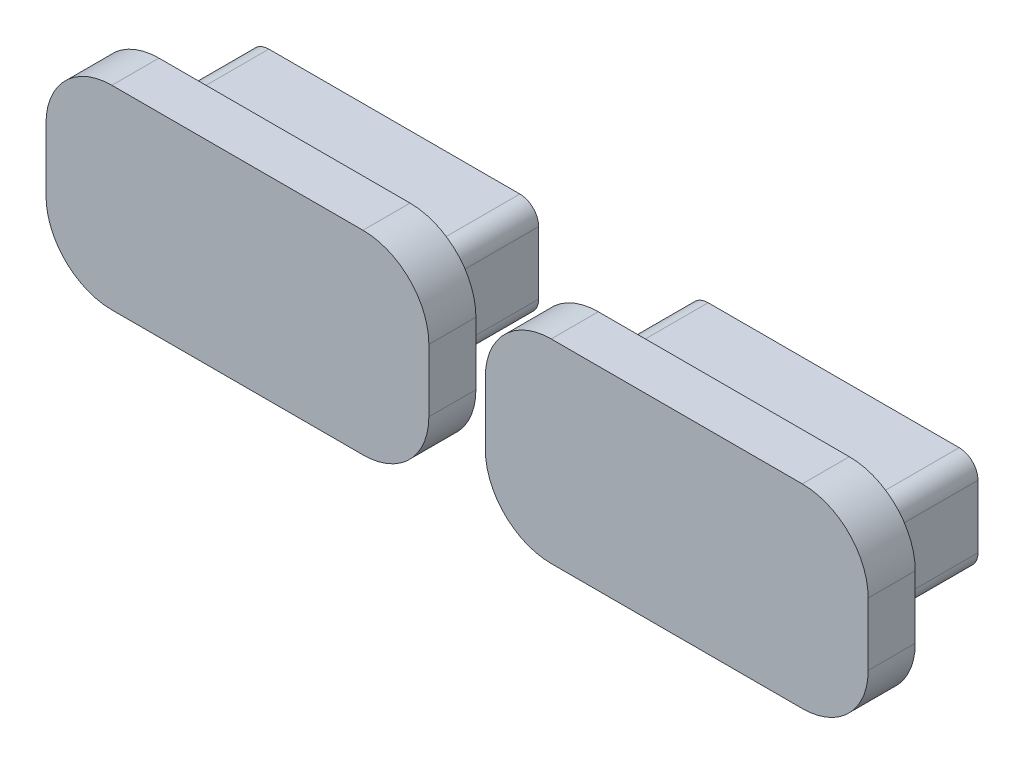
ISO-10303-21;
HEADER;
FILE_DESCRIPTION(('STEP AP214'),'2;1');
FILE_NAME('part.step','',(''),(''),'','','');
FILE_SCHEMA(('AUTOMOTIVE_DESIGN { 1 0 10303 214 1 1 1 1 }'));
ENDSEC;
DATA;
#1=APPLICATION_CONTEXT('core data for automotive mechanical design processes');
#2=APPLICATION_PROTOCOL_DEFINITION('international standard','automotive_design',2000,#1);
#3=PRODUCT_CONTEXT('',#1,'mechanical');
#4=PRODUCT('Part','Part','',(#3));
#5=PRODUCT_RELATED_PRODUCT_CATEGORY('part','',(#4));
#6=PRODUCT_DEFINITION_FORMATION('','',#4);
#7=PRODUCT_DEFINITION_CONTEXT('part definition',#1,'design');
#8=PRODUCT_DEFINITION('design','',#6,#7);
#9=PRODUCT_DEFINITION_SHAPE('','',#8);
#10=(LENGTH_UNIT() NAMED_UNIT(*) SI_UNIT(.MILLI.,.METRE.));
#11=(NAMED_UNIT(*) PLANE_ANGLE_UNIT() SI_UNIT($,.RADIAN.));
#12=(NAMED_UNIT(*) SI_UNIT($,.STERADIAN.) SOLID_ANGLE_UNIT());
#13=UNCERTAINTY_MEASURE_WITH_UNIT(LENGTH_MEASURE(1.E-05),#10,'distance_accuracy_value','');
#14=(GEOMETRIC_REPRESENTATION_CONTEXT(3) GLOBAL_UNCERTAINTY_ASSIGNED_CONTEXT((#13)) GLOBAL_UNIT_ASSIGNED_CONTEXT((#10,
#11,#12)) REPRESENTATION_CONTEXT('',''));
#15=CARTESIAN_POINT('',(0.,0.,0.));
#16=DIRECTION('',(0.,0.,1.));
#17=DIRECTION('',(1.,0.,0.));
#18=AXIS2_PLACEMENT_3D('',#15,#16,#17);
#19=CARTESIAN_POINT('',(34.2749999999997,-52.705,-18.7206083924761));
#20=DIRECTION('',(0.,0.,1.));
#21=DIRECTION('',(1.,0.,0.));
#22=AXIS2_PLACEMENT_3D('',#19,#20,#21);
#23=CYLINDRICAL_SURFACE('',#22,0.761999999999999);
#24=CARTESIAN_POINT('',(34.2749999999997,-52.705,-6.35));
#25=DIRECTION('',(0.,0.,-1.));
#26=DIRECTION('',(-1.,0.,0.));
#27=AXIS2_PLACEMENT_3D('',#24,#25,#26);
#28=CIRCLE('',#27,0.761999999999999);
#29=CARTESIAN_POINT('',(34.2749999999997,-51.943,-6.35));
#30=VERTEX_POINT('',#29);
#31=CARTESIAN_POINT('',(35.0369999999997,-52.705,-6.35));
#32=VERTEX_POINT('',#31);
#33=EDGE_CURVE('E142',#30,#32,#28,.T.);
#34=ORIENTED_EDGE('',*,*,#33,.F.);
#35=DIRECTION('',(0.,0.,1.));
#36=VECTOR('',#35,1.);
#37=CARTESIAN_POINT('',(34.2749999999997,-51.943,-18.7206083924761));
#38=LINE('',#37,#36);
#39=CARTESIAN_POINT('',(34.2749999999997,-51.943,-1.905));
#40=VERTEX_POINT('',#39);
#41=EDGE_CURVE('E47',#30,#40,#38,.T.);
#42=ORIENTED_EDGE('',*,*,#41,.T.);
#43=CARTESIAN_POINT('',(34.2749999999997,-52.705,-1.905));
#44=DIRECTION('',(0.,0.,-1.));
#45=DIRECTION('',(-1.,0.,0.));
#46=AXIS2_PLACEMENT_3D('',#43,#44,#45);
#47=CIRCLE('',#46,0.761999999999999);
#48=CARTESIAN_POINT('',(35.0369999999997,-52.705,-1.905));
#49=VERTEX_POINT('',#48);
#50=EDGE_CURVE('E150',#40,#49,#47,.T.);
#51=ORIENTED_EDGE('',*,*,#50,.T.);
#52=DIRECTION('',(0.,0.,1.));
#53=VECTOR('',#52,1.);
#54=CARTESIAN_POINT('',(35.0369999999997,-52.705,-18.7206083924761));
#55=LINE('',#54,#53);
#56=EDGE_CURVE('E98',#32,#49,#55,.T.);
#57=ORIENTED_EDGE('',*,*,#56,.F.);
#58=EDGE_LOOP('',(#34,#42,#51,#57));
#59=FACE_BOUND('',#58,.T.);
#60=ADVANCED_FACE('F43',(#59),#23,.T.);
#61=CARTESIAN_POINT('',(35.0369999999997,-52.705,-18.7206083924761));
#62=DIRECTION('',(-1.,0.,0.));
#63=DIRECTION('',(0.,0.,1.));
#64=AXIS2_PLACEMENT_3D('',#61,#62,#63);
#65=PLANE('',#64);
#66=DIRECTION('',(0.,-1.,0.));
#67=VECTOR('',#66,1.);
#68=CARTESIAN_POINT('',(35.0369999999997,-52.705,-6.35));
#69=LINE('',#68,#67);
#70=CARTESIAN_POINT('',(35.0369999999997,-55.245,-6.35));
#71=VERTEX_POINT('',#70);
#72=EDGE_CURVE('E105',#32,#71,#69,.T.);
#73=ORIENTED_EDGE('',*,*,#72,.F.);
#74=ORIENTED_EDGE('',*,*,#56,.T.);
#75=DIRECTION('',(0.,-1.,0.));
#76=VECTOR('',#75,1.);
#77=CARTESIAN_POINT('',(35.0369999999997,-52.705,-1.905));
#78=LINE('',#77,#76);
#79=CARTESIAN_POINT('',(35.0369999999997,-55.245,-1.905));
#80=VERTEX_POINT('',#79);
#81=EDGE_CURVE('E149',#49,#80,#78,.T.);
#82=ORIENTED_EDGE('',*,*,#81,.T.);
#83=DIRECTION('',(0.,0.,1.));
#84=VECTOR('',#83,1.);
#85=CARTESIAN_POINT('',(35.0369999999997,-55.245,-18.7206083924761));
#86=LINE('',#85,#84);
#87=EDGE_CURVE('E151',#71,#80,#86,.T.);
#88=ORIENTED_EDGE('',*,*,#87,.F.);
#89=EDGE_LOOP('',(#73,#74,#82,#88));
#90=FACE_BOUND('',#89,.T.);
#91=ADVANCED_FACE('F180',(#90),#65,.F.);
#92=CARTESIAN_POINT('',(34.2749999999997,-55.245,-18.7206083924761));
#93=DIRECTION('',(0.,0.,1.));
#94=DIRECTION('',(1.,0.,0.));
#95=AXIS2_PLACEMENT_3D('',#92,#93,#94);
#96=CYLINDRICAL_SURFACE('',#95,0.761999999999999);
#97=CARTESIAN_POINT('',(34.2749999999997,-55.245,-6.35));
#98=DIRECTION('',(0.,0.,-1.));
#99=DIRECTION('',(-1.,0.,0.));
#100=AXIS2_PLACEMENT_3D('',#97,#98,#99);
#101=CIRCLE('',#100,0.761999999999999);
#102=CARTESIAN_POINT('',(34.2749999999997,-56.007,-6.35));
#103=VERTEX_POINT('',#102);
#104=EDGE_CURVE('E138',#71,#103,#101,.T.);
#105=ORIENTED_EDGE('',*,*,#104,.F.);
#106=ORIENTED_EDGE('',*,*,#87,.T.);
#107=CARTESIAN_POINT('',(34.2749999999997,-55.245,-1.905));
#108=DIRECTION('',(0.,0.,-1.));
#109=DIRECTION('',(-1.,0.,0.));
#110=AXIS2_PLACEMENT_3D('',#107,#108,#109);
#111=CIRCLE('',#110,0.761999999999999);
#112=CARTESIAN_POINT('',(34.2749999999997,-56.007,-1.905));
#113=VERTEX_POINT('',#112);
#114=EDGE_CURVE('E153',#80,#113,#111,.T.);
#115=ORIENTED_EDGE('',*,*,#114,.T.);
#116=DIRECTION('',(0.,0.,1.));
#117=VECTOR('',#116,1.);
#118=CARTESIAN_POINT('',(34.2749999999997,-56.007,-18.7206083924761));
#119=LINE('',#118,#117);
#120=EDGE_CURVE('E154',#103,#113,#119,.T.);
#121=ORIENTED_EDGE('',*,*,#120,.F.);
#122=EDGE_LOOP('',(#105,#106,#115,#121));
#123=FACE_BOUND('',#122,.T.);
#124=ADVANCED_FACE('F183',(#123),#96,.T.);
#125=CARTESIAN_POINT('',(34.2749999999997,-56.007,-18.7206083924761));
#126=DIRECTION('',(0.,1.,0.));
#127=DIRECTION('',(0.,0.,1.));
#128=AXIS2_PLACEMENT_3D('',#125,#126,#127);
#129=PLANE('',#128);
#130=DIRECTION('',(-1.,0.,0.));
#131=VECTOR('',#130,1.);
#132=CARTESIAN_POINT('',(34.2749999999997,-56.007,-6.35));
#133=LINE('',#132,#131);
#134=CARTESIAN_POINT('',(24.1149999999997,-56.007,-6.35));
#135=VERTEX_POINT('',#134);
#136=EDGE_CURVE('E133',#103,#135,#133,.T.);
#137=ORIENTED_EDGE('',*,*,#136,.F.);
#138=ORIENTED_EDGE('',*,*,#120,.T.);
#139=DIRECTION('',(-1.,0.,0.));
#140=VECTOR('',#139,1.);
#141=CARTESIAN_POINT('',(34.2749999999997,-56.007,-1.905));
#142=LINE('',#141,#140);
#143=CARTESIAN_POINT('',(24.1149999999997,-56.007,-1.905));
#144=VERTEX_POINT('',#143);
#145=EDGE_CURVE('E156',#113,#144,#142,.T.);
#146=ORIENTED_EDGE('',*,*,#145,.T.);
#147=DIRECTION('',(0.,0.,1.));
#148=VECTOR('',#147,1.);
#149=CARTESIAN_POINT('',(24.1149999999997,-56.007,-18.7206083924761));
#150=LINE('',#149,#148);
#151=EDGE_CURVE('E157',#135,#144,#150,.T.);
#152=ORIENTED_EDGE('',*,*,#151,.F.);
#153=EDGE_LOOP('',(#137,#138,#146,#152));
#154=FACE_BOUND('',#153,.T.);
#155=ADVANCED_FACE('F185',(#154),#129,.F.);
#156=CARTESIAN_POINT('',(24.1149999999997,-55.245,-18.7206083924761));
#157=DIRECTION('',(0.,0.,1.));
#158=DIRECTION('',(1.,0.,0.));
#159=AXIS2_PLACEMENT_3D('',#156,#157,#158);
#160=CYLINDRICAL_SURFACE('',#159,0.761999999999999);
#161=CARTESIAN_POINT('',(24.1149999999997,-55.245,-6.35));
#162=DIRECTION('',(0.,0.,-1.));
#163=DIRECTION('',(-1.,0.,0.));
#164=AXIS2_PLACEMENT_3D('',#161,#162,#163);
#165=CIRCLE('',#164,0.761999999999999);
#166=CARTESIAN_POINT('',(23.3529999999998,-55.245,-6.35));
#167=VERTEX_POINT('',#166);
#168=EDGE_CURVE('E131',#135,#167,#165,.T.);
#169=ORIENTED_EDGE('',*,*,#168,.F.);
#170=ORIENTED_EDGE('',*,*,#151,.T.);
#171=CARTESIAN_POINT('',(24.1149999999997,-55.245,-1.905));
#172=DIRECTION('',(0.,0.,-1.));
#173=DIRECTION('',(-1.,0.,0.));
#174=AXIS2_PLACEMENT_3D('',#171,#172,#173);
#175=CIRCLE('',#174,0.761999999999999);
#176=CARTESIAN_POINT('',(23.3529999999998,-55.245,-1.905));
#177=VERTEX_POINT('',#176);
#178=EDGE_CURVE('E159',#144,#177,#175,.T.);
#179=ORIENTED_EDGE('',*,*,#178,.T.);
#180=DIRECTION('',(0.,0.,1.));
#181=VECTOR('',#180,1.);
#182=CARTESIAN_POINT('',(23.3529999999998,-55.245,-18.7206083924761));
#183=LINE('',#182,#181);
#184=EDGE_CURVE('E160',#167,#177,#183,.T.);
#185=ORIENTED_EDGE('',*,*,#184,.F.);
#186=EDGE_LOOP('',(#169,#170,#179,#185));
#187=FACE_BOUND('',#186,.T.);
#188=ADVANCED_FACE('F189',(#187),#160,.T.);
#189=CARTESIAN_POINT('',(23.3529999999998,-55.245,-18.7206083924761));
#190=DIRECTION('',(1.,0.,0.));
#191=DIRECTION('',(0.,0.,-1.));
#192=AXIS2_PLACEMENT_3D('',#189,#190,#191);
#193=PLANE('',#192);
#194=DIRECTION('',(0.,1.,0.));
#195=VECTOR('',#194,1.);
#196=CARTESIAN_POINT('',(23.3529999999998,-55.245,-6.35));
#197=LINE('',#196,#195);
#198=CARTESIAN_POINT('',(23.3529999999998,-52.705,-6.35));
#199=VERTEX_POINT('',#198);
#200=EDGE_CURVE('E52',#167,#199,#197,.T.);
#201=ORIENTED_EDGE('',*,*,#200,.F.);
#202=ORIENTED_EDGE('',*,*,#184,.T.);
#203=DIRECTION('',(0.,1.,0.));
#204=VECTOR('',#203,1.);
#205=CARTESIAN_POINT('',(23.3529999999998,-55.245,-1.905));
#206=LINE('',#205,#204);
#207=CARTESIAN_POINT('',(23.3529999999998,-52.705,-1.905));
#208=VERTEX_POINT('',#207);
#209=EDGE_CURVE('E125',#177,#208,#206,.T.);
#210=ORIENTED_EDGE('',*,*,#209,.T.);
#211=DIRECTION('',(0.,0.,1.));
#212=VECTOR('',#211,1.);
#213=CARTESIAN_POINT('',(23.3529999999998,-52.705,-18.7206083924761));
#214=LINE('',#213,#212);
#215=EDGE_CURVE('E116',#199,#208,#214,.T.);
#216=ORIENTED_EDGE('',*,*,#215,.F.);
#217=EDGE_LOOP('',(#201,#202,#210,#216));
#218=FACE_BOUND('',#217,.T.);
#219=ADVANCED_FACE('F122',(#218),#193,.F.);
#220=CARTESIAN_POINT('',(24.1149999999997,-52.705,-18.7206083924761));
#221=DIRECTION('',(0.,0.,1.));
#222=DIRECTION('',(1.,0.,0.));
#223=AXIS2_PLACEMENT_3D('',#220,#221,#222);
#224=CYLINDRICAL_SURFACE('',#223,0.761999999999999);
#225=CARTESIAN_POINT('',(24.1149999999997,-52.705,-6.35));
#226=DIRECTION('',(0.,0.,-1.));
#227=DIRECTION('',(-1.,0.,0.));
#228=AXIS2_PLACEMENT_3D('',#225,#226,#227);
#229=CIRCLE('',#228,0.761999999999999);
#230=CARTESIAN_POINT('',(24.1149999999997,-51.943,-6.35));
#231=VERTEX_POINT('',#230);
#232=EDGE_CURVE('E12',#199,#231,#229,.T.);
#233=ORIENTED_EDGE('',*,*,#232,.F.);
#234=ORIENTED_EDGE('',*,*,#215,.T.);
#235=CARTESIAN_POINT('',(24.1149999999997,-52.705,-1.905));
#236=DIRECTION('',(0.,0.,-1.));
#237=DIRECTION('',(-1.,0.,0.));
#238=AXIS2_PLACEMENT_3D('',#235,#236,#237);
#239=CIRCLE('',#238,0.761999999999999);
#240=CARTESIAN_POINT('',(24.1149999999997,-51.943,-1.905));
#241=VERTEX_POINT('',#240);
#242=EDGE_CURVE('E127',#208,#241,#239,.T.);
#243=ORIENTED_EDGE('',*,*,#242,.T.);
#244=DIRECTION('',(0.,0.,1.));
#245=VECTOR('',#244,1.);
#246=CARTESIAN_POINT('',(24.1149999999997,-51.943,-18.7206083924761));
#247=LINE('',#246,#245);
#248=EDGE_CURVE('E65',#231,#241,#247,.T.);
#249=ORIENTED_EDGE('',*,*,#248,.F.);
#250=EDGE_LOOP('',(#233,#234,#243,#249));
#251=FACE_BOUND('',#250,.T.);
#252=ADVANCED_FACE('F115',(#251),#224,.T.);
#253=CARTESIAN_POINT('',(24.1149999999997,-51.943,-18.7206083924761));
#254=DIRECTION('',(0.,-1.,0.));
#255=DIRECTION('',(0.,0.,-1.));
#256=AXIS2_PLACEMENT_3D('',#253,#254,#255);
#257=PLANE('',#256);
#258=DIRECTION('',(1.,0.,0.));
#259=VECTOR('',#258,1.);
#260=CARTESIAN_POINT('',(24.1149999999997,-51.943,-6.35));
#261=LINE('',#260,#259);
#262=EDGE_CURVE('E145',#231,#30,#261,.T.);
#263=ORIENTED_EDGE('',*,*,#262,.F.);
#264=ORIENTED_EDGE('',*,*,#248,.T.);
#265=DIRECTION('',(1.,0.,0.));
#266=VECTOR('',#265,1.);
#267=CARTESIAN_POINT('',(24.1149999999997,-51.943,-1.905));
#268=LINE('',#267,#266);
#269=EDGE_CURVE('E147',#241,#40,#268,.T.);
#270=ORIENTED_EDGE('',*,*,#269,.T.);
#271=ORIENTED_EDGE('',*,*,#41,.F.);
#272=EDGE_LOOP('',(#263,#264,#270,#271));
#273=FACE_BOUND('',#272,.T.);
#274=ADVANCED_FACE('F175',(#273),#257,.F.);
#275=CARTESIAN_POINT('',(34.2749999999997,-52.705,-1.905));
#276=DIRECTION('',(0.,0.,-1.));
#277=DIRECTION('',(-1.,0.,0.));
#278=AXIS2_PLACEMENT_3D('',#275,#276,#277);
#279=PLANE('',#278);
#280=ORIENTED_EDGE('',*,*,#50,.F.);
#281=ORIENTED_EDGE('',*,*,#269,.F.);
#282=ORIENTED_EDGE('',*,*,#242,.F.);
#283=ORIENTED_EDGE('',*,*,#209,.F.);
#284=ORIENTED_EDGE('',*,*,#178,.F.);
#285=ORIENTED_EDGE('',*,*,#145,.F.);
#286=ORIENTED_EDGE('',*,*,#114,.F.);
#287=ORIENTED_EDGE('',*,*,#81,.F.);
#288=EDGE_LOOP('',(#280,#281,#282,#283,#284,#285,#286,#287));
#289=FACE_BOUND('',#288,.T.);
#290=ADVANCED_FACE('F177',(#289),#279,.F.);
#291=CARTESIAN_POINT('',(-36.785,-36.195,-6.35));
#292=DIRECTION('',(0.,0.,-1.));
#293=DIRECTION('',(-1.,0.,0.));
#294=AXIS2_PLACEMENT_3D('',#291,#292,#293);
#295=PLANE('',#294);
#296=ORIENTED_EDGE('',*,*,#262,.T.);
#297=ORIENTED_EDGE('',*,*,#33,.T.);
#298=ORIENTED_EDGE('',*,*,#72,.T.);
#299=ORIENTED_EDGE('',*,*,#104,.T.);
#300=ORIENTED_EDGE('',*,*,#136,.T.);
#301=ORIENTED_EDGE('',*,*,#168,.T.);
#302=ORIENTED_EDGE('',*,*,#200,.T.);
#303=ORIENTED_EDGE('',*,*,#232,.T.);
#304=EDGE_LOOP('',(#296,#297,#298,#299,#300,#301,#302,#303));
#305=FACE_BOUND('',#304,.T.);
#306=ADVANCED_FACE('F45',(#305),#295,.T.);
#307=CLOSED_SHELL('',(#60,#91,#124,#155,#188,#219,#252,#274,#290,#306));
#308=MANIFOLD_SOLID_BREP('B2',#307);
#309=CARTESIAN_POINT('',(6.33499999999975,-55.245,-18.7206083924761));
#310=DIRECTION('',(0.,0.,1.));
#311=DIRECTION('',(1.,0.,0.));
#312=AXIS2_PLACEMENT_3D('',#309,#310,#311);
#313=CYLINDRICAL_SURFACE('',#312,0.762);
#314=CARTESIAN_POINT('',(6.33499999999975,-55.245,-6.35));
#315=DIRECTION('',(0.,0.,-1.));
#316=DIRECTION('',(-1.,0.,0.));
#317=AXIS2_PLACEMENT_3D('',#314,#315,#316);
#318=CIRCLE('',#317,0.762);
#319=CARTESIAN_POINT('',(6.33499999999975,-56.007,-6.35));
#320=VERTEX_POINT('',#319);
#321=CARTESIAN_POINT('',(5.57299999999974,-55.245,-6.35));
#322=VERTEX_POINT('',#321);
#323=EDGE_CURVE('E379',#320,#322,#318,.T.);
#324=ORIENTED_EDGE('',*,*,#323,.F.);
#325=DIRECTION('',(0.,0.,1.));
#326=VECTOR('',#325,1.);
#327=CARTESIAN_POINT('',(6.33499999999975,-56.007,-18.7206083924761));
#328=LINE('',#327,#326);
#329=CARTESIAN_POINT('',(6.33499999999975,-56.007,-1.905));
#330=VERTEX_POINT('',#329);
#331=EDGE_CURVE('E284',#320,#330,#328,.T.);
#332=ORIENTED_EDGE('',*,*,#331,.T.);
#333=CARTESIAN_POINT('',(6.33499999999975,-55.245,-1.905));
#334=DIRECTION('',(0.,0.,-1.));
#335=DIRECTION('',(-1.,0.,0.));
#336=AXIS2_PLACEMENT_3D('',#333,#334,#335);
#337=CIRCLE('',#336,0.762);
#338=CARTESIAN_POINT('',(5.57299999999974,-55.245,-1.905));
#339=VERTEX_POINT('',#338);
#340=EDGE_CURVE('E387',#330,#339,#337,.T.);
#341=ORIENTED_EDGE('',*,*,#340,.T.);
#342=DIRECTION('',(0.,0.,1.));
#343=VECTOR('',#342,1.);
#344=CARTESIAN_POINT('',(5.57299999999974,-55.245,-18.7206083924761));
#345=LINE('',#344,#343);
#346=EDGE_CURVE('E335',#322,#339,#345,.T.);
#347=ORIENTED_EDGE('',*,*,#346,.F.);
#348=EDGE_LOOP('',(#324,#332,#341,#347));
#349=FACE_BOUND('',#348,.T.);
#350=ADVANCED_FACE('F280',(#349),#313,.T.);
#351=CARTESIAN_POINT('',(5.57299999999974,-55.245,-18.7206083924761));
#352=DIRECTION('',(1.,0.,0.));
#353=DIRECTION('',(0.,0.,-1.));
#354=AXIS2_PLACEMENT_3D('',#351,#352,#353);
#355=PLANE('',#354);
#356=DIRECTION('',(0.,1.,0.));
#357=VECTOR('',#356,1.);
#358=CARTESIAN_POINT('',(5.57299999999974,-55.245,-6.35));
#359=LINE('',#358,#357);
#360=CARTESIAN_POINT('',(5.57299999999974,-52.705,-6.35));
#361=VERTEX_POINT('',#360);
#362=EDGE_CURVE('E342',#322,#361,#359,.T.);
#363=ORIENTED_EDGE('',*,*,#362,.F.);
#364=ORIENTED_EDGE('',*,*,#346,.T.);
#365=DIRECTION('',(0.,1.,0.));
#366=VECTOR('',#365,1.);
#367=CARTESIAN_POINT('',(5.57299999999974,-55.245,-1.905));
#368=LINE('',#367,#366);
#369=CARTESIAN_POINT('',(5.57299999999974,-52.705,-1.905));
#370=VERTEX_POINT('',#369);
#371=EDGE_CURVE('E386',#339,#370,#368,.T.);
#372=ORIENTED_EDGE('',*,*,#371,.T.);
#373=DIRECTION('',(0.,0.,1.));
#374=VECTOR('',#373,1.);
#375=CARTESIAN_POINT('',(5.57299999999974,-52.705,-18.7206083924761));
#376=LINE('',#375,#374);
#377=EDGE_CURVE('E388',#361,#370,#376,.T.);
#378=ORIENTED_EDGE('',*,*,#377,.F.);
#379=EDGE_LOOP('',(#363,#364,#372,#378));
#380=FACE_BOUND('',#379,.T.);
#381=ADVANCED_FACE('F417',(#380),#355,.F.);
#382=CARTESIAN_POINT('',(6.33499999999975,-52.705,-18.7206083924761));
#383=DIRECTION('',(0.,0.,1.));
#384=DIRECTION('',(1.,0.,0.));
#385=AXIS2_PLACEMENT_3D('',#382,#383,#384);
#386=CYLINDRICAL_SURFACE('',#385,0.762);
#387=CARTESIAN_POINT('',(6.33499999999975,-52.705,-6.35));
#388=DIRECTION('',(0.,0.,-1.));
#389=DIRECTION('',(-1.,0.,0.));
#390=AXIS2_PLACEMENT_3D('',#387,#388,#389);
#391=CIRCLE('',#390,0.762);
#392=CARTESIAN_POINT('',(6.33499999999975,-51.943,-6.35));
#393=VERTEX_POINT('',#392);
#394=EDGE_CURVE('E375',#361,#393,#391,.T.);
#395=ORIENTED_EDGE('',*,*,#394,.F.);
#396=ORIENTED_EDGE('',*,*,#377,.T.);
#397=CARTESIAN_POINT('',(6.33499999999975,-52.705,-1.905));
#398=DIRECTION('',(0.,0.,-1.));
#399=DIRECTION('',(-1.,0.,0.));
#400=AXIS2_PLACEMENT_3D('',#397,#398,#399);
#401=CIRCLE('',#400,0.762);
#402=CARTESIAN_POINT('',(6.33499999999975,-51.943,-1.905));
#403=VERTEX_POINT('',#402);
#404=EDGE_CURVE('E390',#370,#403,#401,.T.);
#405=ORIENTED_EDGE('',*,*,#404,.T.);
#406=DIRECTION('',(0.,0.,1.));
#407=VECTOR('',#406,1.);
#408=CARTESIAN_POINT('',(6.33499999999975,-51.943,-18.7206083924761));
#409=LINE('',#408,#407);
#410=EDGE_CURVE('E391',#393,#403,#409,.T.);
#411=ORIENTED_EDGE('',*,*,#410,.F.);
#412=EDGE_LOOP('',(#395,#396,#405,#411));
#413=FACE_BOUND('',#412,.T.);
#414=ADVANCED_FACE('F420',(#413),#386,.T.);
#415=CARTESIAN_POINT('',(6.33499999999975,-51.943,-18.7206083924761));
#416=DIRECTION('',(0.,-1.,0.));
#417=DIRECTION('',(0.,0.,-1.));
#418=AXIS2_PLACEMENT_3D('',#415,#416,#417);
#419=PLANE('',#418);
#420=DIRECTION('',(1.,0.,0.));
#421=VECTOR('',#420,1.);
#422=CARTESIAN_POINT('',(6.33499999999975,-51.943,-6.35));
#423=LINE('',#422,#421);
#424=CARTESIAN_POINT('',(16.4949999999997,-51.943,-6.35));
#425=VERTEX_POINT('',#424);
#426=EDGE_CURVE('E370',#393,#425,#423,.T.);
#427=ORIENTED_EDGE('',*,*,#426,.F.);
#428=ORIENTED_EDGE('',*,*,#410,.T.);
#429=DIRECTION('',(1.,0.,0.));
#430=VECTOR('',#429,1.);
#431=CARTESIAN_POINT('',(6.33499999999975,-51.943,-1.905));
#432=LINE('',#431,#430);
#433=CARTESIAN_POINT('',(16.4949999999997,-51.943,-1.905));
#434=VERTEX_POINT('',#433);
#435=EDGE_CURVE('E393',#403,#434,#432,.T.);
#436=ORIENTED_EDGE('',*,*,#435,.T.);
#437=DIRECTION('',(0.,0.,1.));
#438=VECTOR('',#437,1.);
#439=CARTESIAN_POINT('',(16.4949999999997,-51.943,-18.7206083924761));
#440=LINE('',#439,#438);
#441=EDGE_CURVE('E394',#425,#434,#440,.T.);
#442=ORIENTED_EDGE('',*,*,#441,.F.);
#443=EDGE_LOOP('',(#427,#428,#436,#442));
#444=FACE_BOUND('',#443,.T.);
#445=ADVANCED_FACE('F422',(#444),#419,.F.);
#446=CARTESIAN_POINT('',(16.4949999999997,-52.705,-18.7206083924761));
#447=DIRECTION('',(0.,0.,1.));
#448=DIRECTION('',(1.,0.,0.));
#449=AXIS2_PLACEMENT_3D('',#446,#447,#448);
#450=CYLINDRICAL_SURFACE('',#449,0.761999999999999);
#451=CARTESIAN_POINT('',(16.4949999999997,-52.705,-6.35));
#452=DIRECTION('',(0.,0.,-1.));
#453=DIRECTION('',(-1.,0.,0.));
#454=AXIS2_PLACEMENT_3D('',#451,#452,#453);
#455=CIRCLE('',#454,0.761999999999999);
#456=CARTESIAN_POINT('',(17.2569999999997,-52.705,-6.35));
#457=VERTEX_POINT('',#456);
#458=EDGE_CURVE('E368',#425,#457,#455,.T.);
#459=ORIENTED_EDGE('',*,*,#458,.F.);
#460=ORIENTED_EDGE('',*,*,#441,.T.);
#461=CARTESIAN_POINT('',(16.4949999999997,-52.705,-1.905));
#462=DIRECTION('',(0.,0.,-1.));
#463=DIRECTION('',(-1.,0.,0.));
#464=AXIS2_PLACEMENT_3D('',#461,#462,#463);
#465=CIRCLE('',#464,0.761999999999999);
#466=CARTESIAN_POINT('',(17.2569999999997,-52.705,-1.905));
#467=VERTEX_POINT('',#466);
#468=EDGE_CURVE('E396',#434,#467,#465,.T.);
#469=ORIENTED_EDGE('',*,*,#468,.T.);
#470=DIRECTION('',(0.,0.,1.));
#471=VECTOR('',#470,1.);
#472=CARTESIAN_POINT('',(17.2569999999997,-52.705,-18.7206083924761));
#473=LINE('',#472,#471);
#474=EDGE_CURVE('E397',#457,#467,#473,.T.);
#475=ORIENTED_EDGE('',*,*,#474,.F.);
#476=EDGE_LOOP('',(#459,#460,#469,#475));
#477=FACE_BOUND('',#476,.T.);
#478=ADVANCED_FACE('F426',(#477),#450,.T.);
#479=CARTESIAN_POINT('',(17.2569999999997,-52.705,-18.7206083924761));
#480=DIRECTION('',(-1.,0.,0.));
#481=DIRECTION('',(0.,0.,1.));
#482=AXIS2_PLACEMENT_3D('',#479,#480,#481);
#483=PLANE('',#482);
#484=DIRECTION('',(0.,-1.,0.));
#485=VECTOR('',#484,1.);
#486=CARTESIAN_POINT('',(17.2569999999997,-52.705,-6.35));
#487=LINE('',#486,#485);
#488=CARTESIAN_POINT('',(17.2569999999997,-55.245,-6.35));
#489=VERTEX_POINT('',#488);
#490=EDGE_CURVE('E289',#457,#489,#487,.T.);
#491=ORIENTED_EDGE('',*,*,#490,.F.);
#492=ORIENTED_EDGE('',*,*,#474,.T.);
#493=DIRECTION('',(0.,-1.,0.));
#494=VECTOR('',#493,1.);
#495=CARTESIAN_POINT('',(17.2569999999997,-52.705,-1.905));
#496=LINE('',#495,#494);
#497=CARTESIAN_POINT('',(17.2569999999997,-55.245,-1.905));
#498=VERTEX_POINT('',#497);
#499=EDGE_CURVE('E362',#467,#498,#496,.T.);
#500=ORIENTED_EDGE('',*,*,#499,.T.);
#501=DIRECTION('',(0.,0.,1.));
#502=VECTOR('',#501,1.);
#503=CARTESIAN_POINT('',(17.2569999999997,-55.245,-18.7206083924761));
#504=LINE('',#503,#502);
#505=EDGE_CURVE('E353',#489,#498,#504,.T.);
#506=ORIENTED_EDGE('',*,*,#505,.F.);
#507=EDGE_LOOP('',(#491,#492,#500,#506));
#508=FACE_BOUND('',#507,.T.);
#509=ADVANCED_FACE('F359',(#508),#483,.F.);
#510=CARTESIAN_POINT('',(16.4949999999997,-55.245,-18.7206083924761));
#511=DIRECTION('',(0.,0.,1.));
#512=DIRECTION('',(1.,0.,0.));
#513=AXIS2_PLACEMENT_3D('',#510,#511,#512);
#514=CYLINDRICAL_SURFACE('',#513,0.761999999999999);
#515=CARTESIAN_POINT('',(16.4949999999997,-55.245,-6.35));
#516=DIRECTION('',(0.,0.,-1.));
#517=DIRECTION('',(-1.,0.,0.));
#518=AXIS2_PLACEMENT_3D('',#515,#516,#517);
#519=CIRCLE('',#518,0.761999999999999);
#520=CARTESIAN_POINT('',(16.4949999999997,-56.007,-6.35));
#521=VERTEX_POINT('',#520);
#522=EDGE_CURVE('E41',#489,#521,#519,.T.);
#523=ORIENTED_EDGE('',*,*,#522,.F.);
#524=ORIENTED_EDGE('',*,*,#505,.T.);
#525=CARTESIAN_POINT('',(16.4949999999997,-55.245,-1.905));
#526=DIRECTION('',(0.,0.,-1.));
#527=DIRECTION('',(-1.,0.,0.));
#528=AXIS2_PLACEMENT_3D('',#525,#526,#527);
#529=CIRCLE('',#528,0.761999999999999);
#530=CARTESIAN_POINT('',(16.4949999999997,-56.007,-1.905));
#531=VERTEX_POINT('',#530);
#532=EDGE_CURVE('E364',#498,#531,#529,.T.);
#533=ORIENTED_EDGE('',*,*,#532,.T.);
#534=DIRECTION('',(0.,0.,1.));
#535=VECTOR('',#534,1.);
#536=CARTESIAN_POINT('',(16.4949999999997,-56.007,-18.7206083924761));
#537=LINE('',#536,#535);
#538=EDGE_CURVE('E302',#521,#531,#537,.T.);
#539=ORIENTED_EDGE('',*,*,#538,.F.);
#540=EDGE_LOOP('',(#523,#524,#533,#539));
#541=FACE_BOUND('',#540,.T.);
#542=ADVANCED_FACE('F352',(#541),#514,.T.);
#543=CARTESIAN_POINT('',(16.4949999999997,-56.007,-18.7206083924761));
#544=DIRECTION('',(0.,1.,0.));
#545=DIRECTION('',(0.,0.,1.));
#546=AXIS2_PLACEMENT_3D('',#543,#544,#545);
#547=PLANE('',#546);
#548=DIRECTION('',(-1.,0.,0.));
#549=VECTOR('',#548,1.);
#550=CARTESIAN_POINT('',(16.4949999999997,-56.007,-6.35));
#551=LINE('',#550,#549);
#552=EDGE_CURVE('E382',#521,#320,#551,.T.);
#553=ORIENTED_EDGE('',*,*,#552,.F.);
#554=ORIENTED_EDGE('',*,*,#538,.T.);
#555=DIRECTION('',(-1.,0.,0.));
#556=VECTOR('',#555,1.);
#557=CARTESIAN_POINT('',(16.4949999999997,-56.007,-1.905));
#558=LINE('',#557,#556);
#559=EDGE_CURVE('E384',#531,#330,#558,.T.);
#560=ORIENTED_EDGE('',*,*,#559,.T.);
#561=ORIENTED_EDGE('',*,*,#331,.F.);
#562=EDGE_LOOP('',(#553,#554,#560,#561));
#563=FACE_BOUND('',#562,.T.);
#564=ADVANCED_FACE('F412',(#563),#547,.F.);
#565=CARTESIAN_POINT('',(6.33499999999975,-55.245,-1.905));
#566=DIRECTION('',(0.,0.,-1.));
#567=DIRECTION('',(-1.,0.,0.));
#568=AXIS2_PLACEMENT_3D('',#565,#566,#567);
#569=PLANE('',#568);
#570=ORIENTED_EDGE('',*,*,#340,.F.);
#571=ORIENTED_EDGE('',*,*,#559,.F.);
#572=ORIENTED_EDGE('',*,*,#532,.F.);
#573=ORIENTED_EDGE('',*,*,#499,.F.);
#574=ORIENTED_EDGE('',*,*,#468,.F.);
#575=ORIENTED_EDGE('',*,*,#435,.F.);
#576=ORIENTED_EDGE('',*,*,#404,.F.);
#577=ORIENTED_EDGE('',*,*,#371,.F.);
#578=EDGE_LOOP('',(#570,#571,#572,#573,#574,#575,#576,#577));
#579=FACE_BOUND('',#578,.T.);
#580=ADVANCED_FACE('F414',(#579),#569,.F.);
#581=CARTESIAN_POINT('',(-36.785,-36.195,-6.35));
#582=DIRECTION('',(0.,0.,-1.));
#583=DIRECTION('',(-1.,0.,0.));
#584=AXIS2_PLACEMENT_3D('',#581,#582,#583);
#585=PLANE('',#584);
#586=ORIENTED_EDGE('',*,*,#552,.T.);
#587=ORIENTED_EDGE('',*,*,#323,.T.);
#588=ORIENTED_EDGE('',*,*,#362,.T.);
#589=ORIENTED_EDGE('',*,*,#394,.T.);
#590=ORIENTED_EDGE('',*,*,#426,.T.);
#591=ORIENTED_EDGE('',*,*,#458,.T.);
#592=ORIENTED_EDGE('',*,*,#490,.T.);
#593=ORIENTED_EDGE('',*,*,#522,.T.);
#594=EDGE_LOOP('',(#586,#587,#588,#589,#590,#591,#592,#593));
#595=FACE_BOUND('',#594,.T.);
#596=ADVANCED_FACE('F282',(#595),#585,.T.);
#597=CLOSED_SHELL('',(#350,#381,#414,#445,#478,#509,#542,#564,#580,#596));
#598=MANIFOLD_SOLID_BREP('B6',#597);
#599=CARTESIAN_POINT('',(24.1149999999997,-55.245,-19.2849859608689));
#600=DIRECTION('',(0.,0.,1.));
#601=DIRECTION('',(1.,0.,0.));
#602=AXIS2_PLACEMENT_3D('',#599,#600,#601);
#603=CYLINDRICAL_SURFACE('',#602,2.667);
#604=CARTESIAN_POINT('',(24.1149999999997,-55.245,-1.905));
#605=DIRECTION('',(0.,0.,1.));
#606=DIRECTION('',(1.,0.,0.));
#607=AXIS2_PLACEMENT_3D('',#604,#605,#606);
#608=CIRCLE('',#607,2.667);
#609=CARTESIAN_POINT('',(24.1149999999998,-57.912,-1.905));
#610=VERTEX_POINT('',#609);
#611=CARTESIAN_POINT('',(21.4479999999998,-55.245,-1.905));
#612=VERTEX_POINT('',#611);
#613=EDGE_CURVE('E524',#610,#612,#608,.F.);
#614=ORIENTED_EDGE('',*,*,#613,.F.);
#615=DIRECTION('',(0.,0.,1.));
#616=VECTOR('',#615,1.);
#617=CARTESIAN_POINT('',(24.1149999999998,-57.912,-19.2849859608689));
#618=LINE('',#617,#616);
#619=CARTESIAN_POINT('',(24.1149999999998,-57.912,0.));
#620=VERTEX_POINT('',#619);
#621=EDGE_CURVE('E582',#610,#620,#618,.T.);
#622=ORIENTED_EDGE('',*,*,#621,.T.);
#623=CARTESIAN_POINT('',(24.1149999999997,-55.245,0.));
#624=DIRECTION('',(0.,0.,1.));
#625=DIRECTION('',(1.,0.,0.));
#626=AXIS2_PLACEMENT_3D('',#623,#624,#625);
#627=CIRCLE('',#626,2.667);
#628=CARTESIAN_POINT('',(21.4479999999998,-55.245,0.));
#629=VERTEX_POINT('',#628);
#630=EDGE_CURVE('E585',#629,#620,#627,.T.);
#631=ORIENTED_EDGE('',*,*,#630,.F.);
#632=DIRECTION('',(0.,0.,1.));
#633=VECTOR('',#632,1.);
#634=CARTESIAN_POINT('',(21.4479999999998,-55.245,-19.2849859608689));
#635=LINE('',#634,#633);
#636=EDGE_CURVE('E558',#612,#629,#635,.T.);
#637=ORIENTED_EDGE('',*,*,#636,.F.);
#638=EDGE_LOOP('',(#614,#622,#631,#637));
#639=FACE_BOUND('',#638,.T.);
#640=ADVANCED_FACE('F516',(#639),#603,.T.);
#641=CARTESIAN_POINT('',(21.4479999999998,-52.705,-19.2849859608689));
#642=DIRECTION('',(-1.,0.,0.));
#643=DIRECTION('',(0.,0.,1.));
#644=AXIS2_PLACEMENT_3D('',#641,#642,#643);
#645=PLANE('',#644);
#646=DIRECTION('',(0.,1.,0.));
#647=VECTOR('',#646,1.);
#648=CARTESIAN_POINT('',(21.4479999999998,-52.705,-1.905));
#649=LINE('',#648,#647);
#650=CARTESIAN_POINT('',(21.4479999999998,-52.705,-1.905));
#651=VERTEX_POINT('',#650);
#652=EDGE_CURVE('E654',#612,#651,#649,.T.);
#653=ORIENTED_EDGE('',*,*,#652,.F.);
#654=ORIENTED_EDGE('',*,*,#636,.T.);
#655=DIRECTION('',(0.,-1.,0.));
#656=VECTOR('',#655,1.);
#657=CARTESIAN_POINT('',(21.4479999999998,-52.705,0.));
#658=LINE('',#657,#656);
#659=CARTESIAN_POINT('',(21.4479999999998,-52.705,0.));
#660=VERTEX_POINT('',#659);
#661=EDGE_CURVE('E589',#660,#629,#658,.T.);
#662=ORIENTED_EDGE('',*,*,#661,.F.);
#663=DIRECTION('',(0.,0.,1.));
#664=VECTOR('',#663,1.);
#665=CARTESIAN_POINT('',(21.4479999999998,-52.705,-19.2849859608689));
#666=LINE('',#665,#664);
#667=EDGE_CURVE('E618',#651,#660,#666,.T.);
#668=ORIENTED_EDGE('',*,*,#667,.F.);
#669=EDGE_LOOP('',(#653,#654,#662,#668));
#670=FACE_BOUND('',#669,.T.);
#671=ADVANCED_FACE('F653',(#670),#645,.T.);
#672=CARTESIAN_POINT('',(24.1149999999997,-52.705,-19.2849859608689));
#673=DIRECTION('',(0.,0.,1.));
#674=DIRECTION('',(1.,0.,0.));
#675=AXIS2_PLACEMENT_3D('',#672,#673,#674);
#676=CYLINDRICAL_SURFACE('',#675,2.667);
#677=CARTESIAN_POINT('',(24.1149999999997,-52.705,-1.905));
#678=DIRECTION('',(0.,0.,1.));
#679=DIRECTION('',(1.,0.,0.));
#680=AXIS2_PLACEMENT_3D('',#677,#678,#679);
#681=CIRCLE('',#680,2.667);
#682=CARTESIAN_POINT('',(24.1149999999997,-50.038,-1.905));
#683=VERTEX_POINT('',#682);
#684=EDGE_CURVE('E655',#651,#683,#681,.F.);
#685=ORIENTED_EDGE('',*,*,#684,.F.);
#686=ORIENTED_EDGE('',*,*,#667,.T.);
#687=CARTESIAN_POINT('',(24.1149999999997,-52.705,0.));
#688=DIRECTION('',(0.,0.,1.));
#689=DIRECTION('',(1.,0.,0.));
#690=AXIS2_PLACEMENT_3D('',#687,#688,#689);
#691=CIRCLE('',#690,2.667);
#692=CARTESIAN_POINT('',(24.1149999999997,-50.038,0.));
#693=VERTEX_POINT('',#692);
#694=EDGE_CURVE('E614',#693,#660,#691,.T.);
#695=ORIENTED_EDGE('',*,*,#694,.F.);
#696=DIRECTION('',(0.,0.,1.));
#697=VECTOR('',#696,1.);
#698=CARTESIAN_POINT('',(24.1149999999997,-50.038,-19.2849859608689));
#699=LINE('',#698,#697);
#700=EDGE_CURVE('E620',#683,#693,#699,.T.);
#701=ORIENTED_EDGE('',*,*,#700,.F.);
#702=EDGE_LOOP('',(#685,#686,#695,#701));
#703=FACE_BOUND('',#702,.T.);
#704=ADVANCED_FACE('F651',(#703),#676,.T.);
#705=CARTESIAN_POINT('',(34.2749999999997,-50.038,-19.2849859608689));
#706=DIRECTION('',(0.,1.,0.));
#707=DIRECTION('',(0.,0.,1.));
#708=AXIS2_PLACEMENT_3D('',#705,#706,#707);
#709=PLANE('',#708);
#710=DIRECTION('',(1.,0.,0.));
#711=VECTOR('',#710,1.);
#712=CARTESIAN_POINT('',(34.2749999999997,-50.038,-1.905));
#713=LINE('',#712,#711);
#714=CARTESIAN_POINT('',(34.2749999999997,-50.038,-1.905));
#715=VERTEX_POINT('',#714);
#716=EDGE_CURVE('E648',#683,#715,#713,.T.);
#717=ORIENTED_EDGE('',*,*,#716,.F.);
#718=ORIENTED_EDGE('',*,*,#700,.T.);
#719=DIRECTION('',(-1.,0.,0.));
#720=VECTOR('',#719,1.);
#721=CARTESIAN_POINT('',(34.2749999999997,-50.038,0.));
#722=LINE('',#721,#720);
#723=CARTESIAN_POINT('',(34.2749999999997,-50.038,0.));
#724=VERTEX_POINT('',#723);
#725=EDGE_CURVE('E611',#724,#693,#722,.T.);
#726=ORIENTED_EDGE('',*,*,#725,.F.);
#727=DIRECTION('',(0.,0.,1.));
#728=VECTOR('',#727,1.);
#729=CARTESIAN_POINT('',(34.2749999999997,-50.038,-19.2849859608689));
#730=LINE('',#729,#728);
#731=EDGE_CURVE('E622',#715,#724,#730,.T.);
#732=ORIENTED_EDGE('',*,*,#731,.F.);
#733=EDGE_LOOP('',(#717,#718,#726,#732));
#734=FACE_BOUND('',#733,.T.);
#735=ADVANCED_FACE('F645',(#734),#709,.T.);
#736=CARTESIAN_POINT('',(34.2749999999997,-52.705,-19.2849859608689));
#737=DIRECTION('',(0.,0.,1.));
#738=DIRECTION('',(1.,0.,0.));
#739=AXIS2_PLACEMENT_3D('',#736,#737,#738);
#740=CYLINDRICAL_SURFACE('',#739,2.667);
#741=CARTESIAN_POINT('',(34.2749999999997,-52.705,-1.905));
#742=DIRECTION('',(0.,0.,1.));
#743=DIRECTION('',(1.,0.,0.));
#744=AXIS2_PLACEMENT_3D('',#741,#742,#743);
#745=CIRCLE('',#744,2.667);
#746=CARTESIAN_POINT('',(36.9419999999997,-52.705,-1.905));
#747=VERTEX_POINT('',#746);
#748=EDGE_CURVE('E642',#715,#747,#745,.F.);
#749=ORIENTED_EDGE('',*,*,#748,.F.);
#750=ORIENTED_EDGE('',*,*,#731,.T.);
#751=CARTESIAN_POINT('',(34.2749999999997,-52.705,0.));
#752=DIRECTION('',(0.,0.,1.));
#753=DIRECTION('',(1.,0.,0.));
#754=AXIS2_PLACEMENT_3D('',#751,#752,#753);
#755=CIRCLE('',#754,2.667);
#756=CARTESIAN_POINT('',(36.9419999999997,-52.705,0.));
#757=VERTEX_POINT('',#756);
#758=EDGE_CURVE('E608',#757,#724,#755,.T.);
#759=ORIENTED_EDGE('',*,*,#758,.F.);
#760=DIRECTION('',(0.,0.,1.));
#761=VECTOR('',#760,1.);
#762=CARTESIAN_POINT('',(36.9419999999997,-52.705,-19.2849859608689));
#763=LINE('',#762,#761);
#764=EDGE_CURVE('E624',#747,#757,#763,.T.);
#765=ORIENTED_EDGE('',*,*,#764,.F.);
#766=EDGE_LOOP('',(#749,#750,#759,#765));
#767=FACE_BOUND('',#766,.T.);
#768=ADVANCED_FACE('F640',(#767),#740,.T.);
#769=CARTESIAN_POINT('',(36.9419999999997,-55.245,-19.2849859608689));
#770=DIRECTION('',(1.,0.,0.));
#771=DIRECTION('',(0.,0.,-1.));
#772=AXIS2_PLACEMENT_3D('',#769,#770,#771);
#773=PLANE('',#772);
#774=DIRECTION('',(0.,-1.,0.));
#775=VECTOR('',#774,1.);
#776=CARTESIAN_POINT('',(36.9419999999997,-55.245,-1.905));
#777=LINE('',#776,#775);
#778=CARTESIAN_POINT('',(36.9419999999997,-55.245,-1.905));
#779=VERTEX_POINT('',#778);
#780=EDGE_CURVE('E660',#747,#779,#777,.T.);
#781=ORIENTED_EDGE('',*,*,#780,.F.);
#782=ORIENTED_EDGE('',*,*,#764,.T.);
#783=DIRECTION('',(0.,1.,0.));
#784=VECTOR('',#783,1.);
#785=CARTESIAN_POINT('',(36.9419999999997,-55.245,0.));
#786=LINE('',#785,#784);
#787=CARTESIAN_POINT('',(36.9419999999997,-55.245,0.));
#788=VERTEX_POINT('',#787);
#789=EDGE_CURVE('E605',#788,#757,#786,.T.);
#790=ORIENTED_EDGE('',*,*,#789,.F.);
#791=DIRECTION('',(0.,0.,1.));
#792=VECTOR('',#791,1.);
#793=CARTESIAN_POINT('',(36.9419999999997,-55.245,-19.2849859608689));
#794=LINE('',#793,#792);
#795=EDGE_CURVE('E626',#779,#788,#794,.T.);
#796=ORIENTED_EDGE('',*,*,#795,.F.);
#797=EDGE_LOOP('',(#781,#782,#790,#796));
#798=FACE_BOUND('',#797,.T.);
#799=ADVANCED_FACE('F634',(#798),#773,.T.);
#800=CARTESIAN_POINT('',(34.2749999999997,-55.245,-19.2849859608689));
#801=DIRECTION('',(0.,0.,1.));
#802=DIRECTION('',(1.,0.,0.));
#803=AXIS2_PLACEMENT_3D('',#800,#801,#802);
#804=CYLINDRICAL_SURFACE('',#803,2.667);
#805=CARTESIAN_POINT('',(34.2749999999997,-55.245,-1.905));
#806=DIRECTION('',(0.,0.,1.));
#807=DIRECTION('',(1.,0.,0.));
#808=AXIS2_PLACEMENT_3D('',#805,#806,#807);
#809=CIRCLE('',#808,2.667);
#810=CARTESIAN_POINT('',(34.2749999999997,-57.912,-1.905));
#811=VERTEX_POINT('',#810);
#812=EDGE_CURVE('E551',#779,#811,#809,.F.);
#813=ORIENTED_EDGE('',*,*,#812,.F.);
#814=ORIENTED_EDGE('',*,*,#795,.T.);
#815=CARTESIAN_POINT('',(34.2749999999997,-55.245,0.));
#816=DIRECTION('',(0.,0.,1.));
#817=DIRECTION('',(1.,0.,0.));
#818=AXIS2_PLACEMENT_3D('',#815,#816,#817);
#819=CIRCLE('',#818,2.667);
#820=CARTESIAN_POINT('',(34.2749999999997,-57.912,0.));
#821=VERTEX_POINT('',#820);
#822=EDGE_CURVE('E596',#821,#788,#819,.T.);
#823=ORIENTED_EDGE('',*,*,#822,.F.);
#824=DIRECTION('',(0.,0.,1.));
#825=VECTOR('',#824,1.);
#826=CARTESIAN_POINT('',(34.2749999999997,-57.912,-19.2849859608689));
#827=LINE('',#826,#825);
#828=EDGE_CURVE('E588',#811,#821,#827,.T.);
#829=ORIENTED_EDGE('',*,*,#828,.F.);
#830=EDGE_LOOP('',(#813,#814,#823,#829));
#831=FACE_BOUND('',#830,.T.);
#832=ADVANCED_FACE('F631',(#831),#804,.T.);
#833=CARTESIAN_POINT('',(24.1149999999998,-57.912,-19.2849859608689));
#834=DIRECTION('',(0.,-1.,0.));
#835=DIRECTION('',(0.,0.,-1.));
#836=AXIS2_PLACEMENT_3D('',#833,#834,#835);
#837=PLANE('',#836);
#838=DIRECTION('',(-1.,0.,0.));
#839=VECTOR('',#838,1.);
#840=CARTESIAN_POINT('',(24.1149999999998,-57.912,-1.905));
#841=LINE('',#840,#839);
#842=EDGE_CURVE('E278',#811,#610,#841,.T.);
#843=ORIENTED_EDGE('',*,*,#842,.F.);
#844=ORIENTED_EDGE('',*,*,#828,.T.);
#845=DIRECTION('',(1.,0.,0.));
#846=VECTOR('',#845,1.);
#847=CARTESIAN_POINT('',(24.1149999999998,-57.912,0.));
#848=LINE('',#847,#846);
#849=EDGE_CURVE('E591',#620,#821,#848,.T.);
#850=ORIENTED_EDGE('',*,*,#849,.F.);
#851=ORIENTED_EDGE('',*,*,#621,.F.);
#852=EDGE_LOOP('',(#843,#844,#850,#851));
#853=FACE_BOUND('',#852,.T.);
#854=ADVANCED_FACE('F592',(#853),#837,.T.);
#855=CARTESIAN_POINT('',(24.1149999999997,-55.245,0.));
#856=DIRECTION('',(0.,0.,1.));
#857=DIRECTION('',(1.,0.,0.));
#858=AXIS2_PLACEMENT_3D('',#855,#856,#857);
#859=PLANE('',#858);
#860=ORIENTED_EDGE('',*,*,#630,.T.);
#861=ORIENTED_EDGE('',*,*,#849,.T.);
#862=ORIENTED_EDGE('',*,*,#822,.T.);
#863=ORIENTED_EDGE('',*,*,#789,.T.);
#864=ORIENTED_EDGE('',*,*,#758,.T.);
#865=ORIENTED_EDGE('',*,*,#725,.T.);
#866=ORIENTED_EDGE('',*,*,#694,.T.);
#867=ORIENTED_EDGE('',*,*,#661,.T.);
#868=EDGE_LOOP('',(#860,#861,#862,#863,#864,#865,#866,#867));
#869=FACE_BOUND('',#868,.T.);
#870=ADVANCED_FACE('F598',(#869),#859,.T.);
#871=CARTESIAN_POINT('',(0.,0.,-1.905));
#872=DIRECTION('',(0.,0.,1.));
#873=DIRECTION('',(0.,-1.,0.));
#874=AXIS2_PLACEMENT_3D('',#871,#872,#873);
#875=PLANE('',#874);
#876=ORIENTED_EDGE('',*,*,#613,.T.);
#877=ORIENTED_EDGE('',*,*,#652,.T.);
#878=ORIENTED_EDGE('',*,*,#684,.T.);
#879=ORIENTED_EDGE('',*,*,#716,.T.);
#880=ORIENTED_EDGE('',*,*,#748,.T.);
#881=ORIENTED_EDGE('',*,*,#780,.T.);
#882=ORIENTED_EDGE('',*,*,#812,.T.);
#883=ORIENTED_EDGE('',*,*,#842,.T.);
#884=EDGE_LOOP('',(#876,#877,#878,#879,#880,#881,#882,#883));
#885=FACE_BOUND('',#884,.T.);
#886=ADVANCED_FACE('F662',(#885),#875,.F.);
#887=CLOSED_SHELL('',(#640,#671,#704,#735,#768,#799,#832,#854,#870,#886));
#888=MANIFOLD_SOLID_BREP('B35',#887);
#889=CARTESIAN_POINT('',(16.4949999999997,-52.705,-19.2849859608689));
#890=DIRECTION('',(0.,0.,1.));
#891=DIRECTION('',(1.,0.,0.));
#892=AXIS2_PLACEMENT_3D('',#889,#890,#891);
#893=CYLINDRICAL_SURFACE('',#892,2.667);
#894=CARTESIAN_POINT('',(16.4949999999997,-52.705,-1.905));
#895=DIRECTION('',(0.,0.,1.));
#896=DIRECTION('',(1.,0.,0.));
#897=AXIS2_PLACEMENT_3D('',#894,#895,#896);
#898=CIRCLE('',#897,2.667);
#899=CARTESIAN_POINT('',(16.4949999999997,-50.038,-1.905));
#900=VERTEX_POINT('',#899);
#901=CARTESIAN_POINT('',(19.1619999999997,-52.705,-1.905));
#902=VERTEX_POINT('',#901);
#903=EDGE_CURVE('E751',#900,#902,#898,.F.);
#904=ORIENTED_EDGE('',*,*,#903,.F.);
#905=DIRECTION('',(0.,0.,1.));
#906=VECTOR('',#905,1.);
#907=CARTESIAN_POINT('',(16.4949999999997,-50.038,-19.2849859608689));
#908=LINE('',#907,#906);
#909=CARTESIAN_POINT('',(16.4949999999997,-50.038,0.));
#910=VERTEX_POINT('',#909);
#911=EDGE_CURVE('E809',#900,#910,#908,.T.);
#912=ORIENTED_EDGE('',*,*,#911,.T.);
#913=CARTESIAN_POINT('',(16.4949999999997,-52.705,0.));
#914=DIRECTION('',(0.,0.,1.));
#915=DIRECTION('',(1.,0.,0.));
#916=AXIS2_PLACEMENT_3D('',#913,#914,#915);
#917=CIRCLE('',#916,2.667);
#918=CARTESIAN_POINT('',(19.1619999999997,-52.705,0.));
#919=VERTEX_POINT('',#918);
#920=EDGE_CURVE('E812',#919,#910,#917,.T.);
#921=ORIENTED_EDGE('',*,*,#920,.F.);
#922=DIRECTION('',(0.,0.,1.));
#923=VECTOR('',#922,1.);
#924=CARTESIAN_POINT('',(19.1619999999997,-52.705,-19.2849859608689));
#925=LINE('',#924,#923);
#926=EDGE_CURVE('E785',#902,#919,#925,.T.);
#927=ORIENTED_EDGE('',*,*,#926,.F.);
#928=EDGE_LOOP('',(#904,#912,#921,#927));
#929=FACE_BOUND('',#928,.T.);
#930=ADVANCED_FACE('F743',(#929),#893,.T.);
#931=CARTESIAN_POINT('',(19.1619999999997,-55.245,-19.2849859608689));
#932=DIRECTION('',(1.,0.,0.));
#933=DIRECTION('',(0.,1.,0.));
#934=AXIS2_PLACEMENT_3D('',#931,#932,#933);
#935=PLANE('',#934);
#936=DIRECTION('',(0.,-1.,0.));
#937=VECTOR('',#936,1.);
#938=CARTESIAN_POINT('',(19.1619999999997,-55.245,-1.905));
#939=LINE('',#938,#937);
#940=CARTESIAN_POINT('',(19.1619999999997,-55.245,-1.905));
#941=VERTEX_POINT('',#940);
#942=EDGE_CURVE('E881',#902,#941,#939,.T.);
#943=ORIENTED_EDGE('',*,*,#942,.F.);
#944=ORIENTED_EDGE('',*,*,#926,.T.);
#945=DIRECTION('',(0.,1.,0.));
#946=VECTOR('',#945,1.);
#947=CARTESIAN_POINT('',(19.1619999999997,-55.245,0.));
#948=LINE('',#947,#946);
#949=CARTESIAN_POINT('',(19.1619999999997,-55.245,0.));
#950=VERTEX_POINT('',#949);
#951=EDGE_CURVE('E816',#950,#919,#948,.T.);
#952=ORIENTED_EDGE('',*,*,#951,.F.);
#953=DIRECTION('',(0.,0.,1.));
#954=VECTOR('',#953,1.);
#955=CARTESIAN_POINT('',(19.1619999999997,-55.245,-19.2849859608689));
#956=LINE('',#955,#954);
#957=EDGE_CURVE('E845',#941,#950,#956,.T.);
#958=ORIENTED_EDGE('',*,*,#957,.F.);
#959=EDGE_LOOP('',(#943,#944,#952,#958));
#960=FACE_BOUND('',#959,.T.);
#961=ADVANCED_FACE('F880',(#960),#935,.T.);
#962=CARTESIAN_POINT('',(16.4949999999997,-55.245,-19.2849859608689));
#963=DIRECTION('',(0.,0.,1.));
#964=DIRECTION('',(1.,0.,0.));
#965=AXIS2_PLACEMENT_3D('',#962,#963,#964);
#966=CYLINDRICAL_SURFACE('',#965,2.667);
#967=CARTESIAN_POINT('',(16.4949999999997,-55.245,-1.905));
#968=DIRECTION('',(0.,0.,1.));
#969=DIRECTION('',(1.,0.,0.));
#970=AXIS2_PLACEMENT_3D('',#967,#968,#969);
#971=CIRCLE('',#970,2.667);
#972=CARTESIAN_POINT('',(16.4949999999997,-57.912,-1.905));
#973=VERTEX_POINT('',#972);
#974=EDGE_CURVE('E882',#941,#973,#971,.F.);
#975=ORIENTED_EDGE('',*,*,#974,.F.);
#976=ORIENTED_EDGE('',*,*,#957,.T.);
#977=CARTESIAN_POINT('',(16.4949999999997,-55.245,0.));
#978=DIRECTION('',(0.,0.,1.));
#979=DIRECTION('',(1.,0.,0.));
#980=AXIS2_PLACEMENT_3D('',#977,#978,#979);
#981=CIRCLE('',#980,2.667);
#982=CARTESIAN_POINT('',(16.4949999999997,-57.912,0.));
#983=VERTEX_POINT('',#982);
#984=EDGE_CURVE('E841',#983,#950,#981,.T.);
#985=ORIENTED_EDGE('',*,*,#984,.F.);
#986=DIRECTION('',(0.,0.,1.));
#987=VECTOR('',#986,1.);
#988=CARTESIAN_POINT('',(16.4949999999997,-57.912,-19.2849859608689));
#989=LINE('',#988,#987);
#990=EDGE_CURVE('E847',#973,#983,#989,.T.);
#991=ORIENTED_EDGE('',*,*,#990,.F.);
#992=EDGE_LOOP('',(#975,#976,#985,#991));
#993=FACE_BOUND('',#992,.T.);
#994=ADVANCED_FACE('F878',(#993),#966,.T.);
#995=CARTESIAN_POINT('',(6.33499999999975,-57.912,-19.2849859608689));
#996=DIRECTION('',(0.,-1.,0.));
#997=DIRECTION('',(0.,0.,-1.));
#998=AXIS2_PLACEMENT_3D('',#995,#996,#997);
#999=PLANE('',#998);
#1000=DIRECTION('',(-1.,0.,0.));
#1001=VECTOR('',#1000,1.);
#1002=CARTESIAN_POINT('',(6.33499999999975,-57.912,-1.905));
#1003=LINE('',#1002,#1001);
#1004=CARTESIAN_POINT('',(6.33499999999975,-57.912,-1.905));
#1005=VERTEX_POINT('',#1004);
#1006=EDGE_CURVE('E875',#973,#1005,#1003,.T.);
#1007=ORIENTED_EDGE('',*,*,#1006,.F.);
#1008=ORIENTED_EDGE('',*,*,#990,.T.);
#1009=DIRECTION('',(1.,0.,0.));
#1010=VECTOR('',#1009,1.);
#1011=CARTESIAN_POINT('',(6.33499999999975,-57.912,0.));
#1012=LINE('',#1011,#1010);
#1013=CARTESIAN_POINT('',(6.33499999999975,-57.912,0.));
#1014=VERTEX_POINT('',#1013);
#1015=EDGE_CURVE('E838',#1014,#983,#1012,.T.);
#1016=ORIENTED_EDGE('',*,*,#1015,.F.);
#1017=DIRECTION('',(0.,0.,1.));
#1018=VECTOR('',#1017,1.);
#1019=CARTESIAN_POINT('',(6.33499999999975,-57.912,-19.2849859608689));
#1020=LINE('',#1019,#1018);
#1021=EDGE_CURVE('E849',#1005,#1014,#1020,.T.);
#1022=ORIENTED_EDGE('',*,*,#1021,.F.);
#1023=EDGE_LOOP('',(#1007,#1008,#1016,#1022));
#1024=FACE_BOUND('',#1023,.T.);
#1025=ADVANCED_FACE('F872',(#1024),#999,.T.);
#1026=CARTESIAN_POINT('',(6.33499999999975,-55.245,-19.2849859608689));
#1027=DIRECTION('',(0.,0.,1.));
#1028=DIRECTION('',(1.,0.,0.));
#1029=AXIS2_PLACEMENT_3D('',#1026,#1027,#1028);
#1030=CYLINDRICAL_SURFACE('',#1029,2.667);
#1031=CARTESIAN_POINT('',(6.33499999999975,-55.245,-1.905));
#1032=DIRECTION('',(0.,0.,1.));
#1033=DIRECTION('',(1.,0.,0.));
#1034=AXIS2_PLACEMENT_3D('',#1031,#1032,#1033);
#1035=CIRCLE('',#1034,2.667);
#1036=CARTESIAN_POINT('',(3.66799999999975,-55.245,-1.905));
#1037=VERTEX_POINT('',#1036);
#1038=EDGE_CURVE('E869',#1005,#1037,#1035,.F.);
#1039=ORIENTED_EDGE('',*,*,#1038,.F.);
#1040=ORIENTED_EDGE('',*,*,#1021,.T.);
#1041=CARTESIAN_POINT('',(6.33499999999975,-55.245,0.));
#1042=DIRECTION('',(0.,0.,1.));
#1043=DIRECTION('',(1.,0.,0.));
#1044=AXIS2_PLACEMENT_3D('',#1041,#1042,#1043);
#1045=CIRCLE('',#1044,2.667);
#1046=CARTESIAN_POINT('',(3.66799999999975,-55.245,0.));
#1047=VERTEX_POINT('',#1046);
#1048=EDGE_CURVE('E835',#1047,#1014,#1045,.T.);
#1049=ORIENTED_EDGE('',*,*,#1048,.F.);
#1050=DIRECTION('',(0.,0.,1.));
#1051=VECTOR('',#1050,1.);
#1052=CARTESIAN_POINT('',(3.66799999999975,-55.245,-19.2849859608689));
#1053=LINE('',#1052,#1051);
#1054=EDGE_CURVE('E851',#1037,#1047,#1053,.T.);
#1055=ORIENTED_EDGE('',*,*,#1054,.F.);
#1056=EDGE_LOOP('',(#1039,#1040,#1049,#1055));
#1057=FACE_BOUND('',#1056,.T.);
#1058=ADVANCED_FACE('F867',(#1057),#1030,.T.);
#1059=CARTESIAN_POINT('',(3.66799999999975,-52.705,-19.2849859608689));
#1060=DIRECTION('',(-1.,0.,0.));
#1061=DIRECTION('',(0.,0.,1.));
#1062=AXIS2_PLACEMENT_3D('',#1059,#1060,#1061);
#1063=PLANE('',#1062);
#1064=DIRECTION('',(0.,1.,0.));
#1065=VECTOR('',#1064,1.);
#1066=CARTESIAN_POINT('',(3.66799999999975,-52.705,-1.905));
#1067=LINE('',#1066,#1065);
#1068=CARTESIAN_POINT('',(3.66799999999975,-52.705,-1.905));
#1069=VERTEX_POINT('',#1068);
#1070=EDGE_CURVE('E887',#1037,#1069,#1067,.T.);
#1071=ORIENTED_EDGE('',*,*,#1070,.F.);
#1072=ORIENTED_EDGE('',*,*,#1054,.T.);
#1073=DIRECTION('',(0.,-1.,0.));
#1074=VECTOR('',#1073,1.);
#1075=CARTESIAN_POINT('',(3.66799999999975,-52.705,0.));
#1076=LINE('',#1075,#1074);
#1077=CARTESIAN_POINT('',(3.66799999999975,-52.705,0.));
#1078=VERTEX_POINT('',#1077);
#1079=EDGE_CURVE('E832',#1078,#1047,#1076,.T.);
#1080=ORIENTED_EDGE('',*,*,#1079,.F.);
#1081=DIRECTION('',(0.,0.,1.));
#1082=VECTOR('',#1081,1.);
#1083=CARTESIAN_POINT('',(3.66799999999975,-52.705,-19.2849859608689));
#1084=LINE('',#1083,#1082);
#1085=EDGE_CURVE('E853',#1069,#1078,#1084,.T.);
#1086=ORIENTED_EDGE('',*,*,#1085,.F.);
#1087=EDGE_LOOP('',(#1071,#1072,#1080,#1086));
#1088=FACE_BOUND('',#1087,.T.);
#1089=ADVANCED_FACE('F861',(#1088),#1063,.T.);
#1090=CARTESIAN_POINT('',(6.33499999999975,-52.705,-19.2849859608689));
#1091=DIRECTION('',(0.,0.,1.));
#1092=DIRECTION('',(1.,0.,0.));
#1093=AXIS2_PLACEMENT_3D('',#1090,#1091,#1092);
#1094=CYLINDRICAL_SURFACE('',#1093,2.667);
#1095=CARTESIAN_POINT('',(6.33499999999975,-52.705,-1.905));
#1096=DIRECTION('',(0.,0.,1.));
#1097=DIRECTION('',(1.,0.,0.));
#1098=AXIS2_PLACEMENT_3D('',#1095,#1096,#1097);
#1099=CIRCLE('',#1098,2.667);
#1100=CARTESIAN_POINT('',(6.33499999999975,-50.038,-1.905));
#1101=VERTEX_POINT('',#1100);
#1102=EDGE_CURVE('E778',#1069,#1101,#1099,.F.);
#1103=ORIENTED_EDGE('',*,*,#1102,.F.);
#1104=ORIENTED_EDGE('',*,*,#1085,.T.);
#1105=CARTESIAN_POINT('',(6.33499999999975,-52.705,0.));
#1106=DIRECTION('',(0.,0.,1.));
#1107=DIRECTION('',(1.,0.,0.));
#1108=AXIS2_PLACEMENT_3D('',#1105,#1106,#1107);
#1109=CIRCLE('',#1108,2.667);
#1110=CARTESIAN_POINT('',(6.33499999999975,-50.038,0.));
#1111=VERTEX_POINT('',#1110);
#1112=EDGE_CURVE('E823',#1111,#1078,#1109,.T.);
#1113=ORIENTED_EDGE('',*,*,#1112,.F.);
#1114=DIRECTION('',(0.,0.,1.));
#1115=VECTOR('',#1114,1.);
#1116=CARTESIAN_POINT('',(6.33499999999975,-50.038,-19.2849859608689));
#1117=LINE('',#1116,#1115);
#1118=EDGE_CURVE('E815',#1101,#1111,#1117,.T.);
#1119=ORIENTED_EDGE('',*,*,#1118,.F.);
#1120=EDGE_LOOP('',(#1103,#1104,#1113,#1119));
#1121=FACE_BOUND('',#1120,.T.);
#1122=ADVANCED_FACE('F858',(#1121),#1094,.T.);
#1123=CARTESIAN_POINT('',(16.4949999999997,-50.038,-19.2849859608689));
#1124=DIRECTION('',(0.,1.,0.));
#1125=DIRECTION('',(0.,0.,1.));
#1126=AXIS2_PLACEMENT_3D('',#1123,#1124,#1125);
#1127=PLANE('',#1126);
#1128=DIRECTION('',(1.,0.,0.));
#1129=VECTOR('',#1128,1.);
#1130=CARTESIAN_POINT('',(16.4949999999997,-50.038,-1.905));
#1131=LINE('',#1130,#1129);
#1132=EDGE_CURVE('E514',#1101,#900,#1131,.T.);
#1133=ORIENTED_EDGE('',*,*,#1132,.F.);
#1134=ORIENTED_EDGE('',*,*,#1118,.T.);
#1135=DIRECTION('',(-1.,0.,0.));
#1136=VECTOR('',#1135,1.);
#1137=CARTESIAN_POINT('',(16.4949999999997,-50.038,0.));
#1138=LINE('',#1137,#1136);
#1139=EDGE_CURVE('E818',#910,#1111,#1138,.T.);
#1140=ORIENTED_EDGE('',*,*,#1139,.F.);
#1141=ORIENTED_EDGE('',*,*,#911,.F.);
#1142=EDGE_LOOP('',(#1133,#1134,#1140,#1141));
#1143=FACE_BOUND('',#1142,.T.);
#1144=ADVANCED_FACE('F819',(#1143),#1127,.T.);
#1145=CARTESIAN_POINT('',(16.4949999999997,-52.705,0.));
#1146=DIRECTION('',(0.,0.,1.));
#1147=DIRECTION('',(1.,0.,0.));
#1148=AXIS2_PLACEMENT_3D('',#1145,#1146,#1147);
#1149=PLANE('',#1148);
#1150=ORIENTED_EDGE('',*,*,#920,.T.);
#1151=ORIENTED_EDGE('',*,*,#1139,.T.);
#1152=ORIENTED_EDGE('',*,*,#1112,.T.);
#1153=ORIENTED_EDGE('',*,*,#1079,.T.);
#1154=ORIENTED_EDGE('',*,*,#1048,.T.);
#1155=ORIENTED_EDGE('',*,*,#1015,.T.);
#1156=ORIENTED_EDGE('',*,*,#984,.T.);
#1157=ORIENTED_EDGE('',*,*,#951,.T.);
#1158=EDGE_LOOP('',(#1150,#1151,#1152,#1153,#1154,#1155,#1156,#1157));
#1159=FACE_BOUND('',#1158,.T.);
#1160=ADVANCED_FACE('F825',(#1159),#1149,.T.);
#1161=CARTESIAN_POINT('',(0.,0.,-1.905));
#1162=DIRECTION('',(0.,0.,1.));
#1163=DIRECTION('',(0.,-1.,0.));
#1164=AXIS2_PLACEMENT_3D('',#1161,#1162,#1163);
#1165=PLANE('',#1164);
#1166=ORIENTED_EDGE('',*,*,#903,.T.);
#1167=ORIENTED_EDGE('',*,*,#942,.T.);
#1168=ORIENTED_EDGE('',*,*,#974,.T.);
#1169=ORIENTED_EDGE('',*,*,#1006,.T.);
#1170=ORIENTED_EDGE('',*,*,#1038,.T.);
#1171=ORIENTED_EDGE('',*,*,#1070,.T.);
#1172=ORIENTED_EDGE('',*,*,#1102,.T.);
#1173=ORIENTED_EDGE('',*,*,#1132,.T.);
#1174=EDGE_LOOP('',(#1166,#1167,#1168,#1169,#1170,#1171,#1172,#1173));
#1175=FACE_BOUND('',#1174,.T.);
#1176=ADVANCED_FACE('F889',(#1175),#1165,.F.);
#1177=CLOSED_SHELL('',(#930,#961,#994,#1025,#1058,#1089,#1122,#1144,#1160,#1176));
#1178=MANIFOLD_SOLID_BREP('B272',#1177);
#1179=ADVANCED_BREP_SHAPE_REPRESENTATION('',(#18,#308,#598,#888,#1178),#14);
#1180=SHAPE_DEFINITION_REPRESENTATION(#9,#1179);
ENDSEC;
END-ISO-10303-21;
